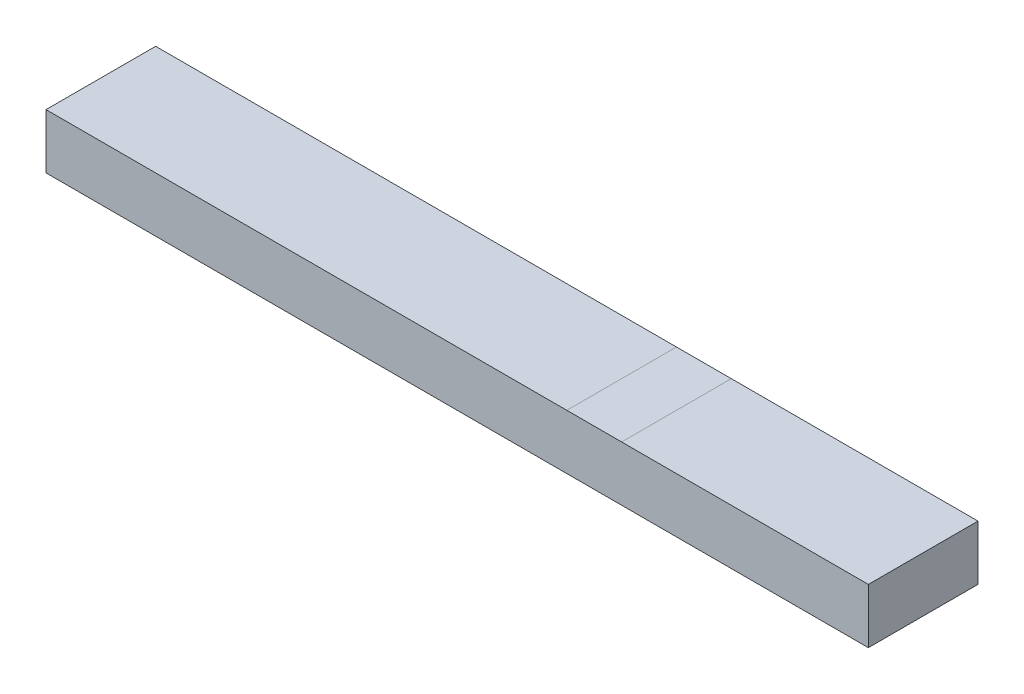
ISO-10303-21;
HEADER;
FILE_DESCRIPTION(('STEP AP214'),'2;1');
FILE_NAME('part.step','',(''),(''),'','','');
FILE_SCHEMA(('AUTOMOTIVE_DESIGN { 1 0 10303 214 1 1 1 1 }'));
ENDSEC;
DATA;
#1=APPLICATION_CONTEXT('core data for automotive mechanical design processes');
#2=APPLICATION_PROTOCOL_DEFINITION('international standard','automotive_design',2000,#1);
#3=PRODUCT_CONTEXT('',#1,'mechanical');
#4=PRODUCT('Part','Part','',(#3));
#5=PRODUCT_RELATED_PRODUCT_CATEGORY('part','',(#4));
#6=PRODUCT_DEFINITION_FORMATION('','',#4);
#7=PRODUCT_DEFINITION_CONTEXT('part definition',#1,'design');
#8=PRODUCT_DEFINITION('design','',#6,#7);
#9=PRODUCT_DEFINITION_SHAPE('','',#8);
#10=(LENGTH_UNIT() NAMED_UNIT(*) SI_UNIT(.MILLI.,.METRE.));
#11=(NAMED_UNIT(*) PLANE_ANGLE_UNIT() SI_UNIT($,.RADIAN.));
#12=(NAMED_UNIT(*) SI_UNIT($,.STERADIAN.) SOLID_ANGLE_UNIT());
#13=UNCERTAINTY_MEASURE_WITH_UNIT(LENGTH_MEASURE(1.E-05),#10,'distance_accuracy_value','');
#14=(GEOMETRIC_REPRESENTATION_CONTEXT(3) GLOBAL_UNCERTAINTY_ASSIGNED_CONTEXT((#13)) GLOBAL_UNIT_ASSIGNED_CONTEXT((#10,
#11,#12)) REPRESENTATION_CONTEXT('',''));
#15=CARTESIAN_POINT('',(0.,0.,0.));
#16=DIRECTION('',(0.,0.,1.));
#17=DIRECTION('',(1.,0.,0.));
#18=AXIS2_PLACEMENT_3D('',#15,#16,#17);
#19=CARTESIAN_POINT('',(750.,25.,50.));
#20=DIRECTION('',(0.,-1.,0.));
#21=DIRECTION('',(0.,0.,-1.));
#22=AXIS2_PLACEMENT_3D('',#19,#20,#21);
#23=PLANE('',#22);
#24=DIRECTION('',(0.,0.,1.));
#25=VECTOR('',#24,1.);
#26=CARTESIAN_POINT('',(525.,25.,50.));
#27=LINE('',#26,#25);
#28=CARTESIAN_POINT('',(525.,25.,-50.));
#29=VERTEX_POINT('',#28);
#30=CARTESIAN_POINT('',(525.,25.,50.));
#31=VERTEX_POINT('',#30);
#32=EDGE_CURVE('E11',#29,#31,#27,.T.);
#33=ORIENTED_EDGE('',*,*,#32,.F.);
#34=DIRECTION('',(-1.,0.,0.));
#35=VECTOR('',#34,1.);
#36=CARTESIAN_POINT('',(750.,25.,-50.));
#37=LINE('',#36,#35);
#38=CARTESIAN_POINT('',(475.,25.,-50.));
#39=VERTEX_POINT('',#38);
#40=EDGE_CURVE('E115',#29,#39,#37,.T.);
#41=ORIENTED_EDGE('',*,*,#40,.T.);
#42=DIRECTION('',(0.,0.,1.));
#43=VECTOR('',#42,1.);
#44=CARTESIAN_POINT('',(475.,25.,50.));
#45=LINE('',#44,#43);
#46=CARTESIAN_POINT('',(475.,25.,50.));
#47=VERTEX_POINT('',#46);
#48=EDGE_CURVE('E52',#39,#47,#45,.T.);
#49=ORIENTED_EDGE('',*,*,#48,.T.);
#50=DIRECTION('',(-1.,0.,0.));
#51=VECTOR('',#50,1.);
#52=CARTESIAN_POINT('',(750.,25.,50.));
#53=LINE('',#52,#51);
#54=EDGE_CURVE('E125',#31,#47,#53,.T.);
#55=ORIENTED_EDGE('',*,*,#54,.F.);
#56=EDGE_LOOP('',(#33,#41,#49,#55));
#57=FACE_BOUND('',#56,.T.);
#58=ADVANCED_FACE('F43',(#57),#23,.F.);
#59=ORIENTED_EDGE('',*,*,#48,.F.);
#60=CARTESIAN_POINT('',(0.,25.,-50.));
#61=VERTEX_POINT('',#60);
#62=EDGE_CURVE('E117',#39,#61,#37,.T.);
#63=ORIENTED_EDGE('',*,*,#62,.T.);
#64=DIRECTION('',(0.,0.,1.));
#65=VECTOR('',#64,1.);
#66=CARTESIAN_POINT('',(0.,25.,50.));
#67=LINE('',#66,#65);
#68=CARTESIAN_POINT('',(0.,25.,50.));
#69=VERTEX_POINT('',#68);
#70=EDGE_CURVE('E144',#61,#69,#67,.T.);
#71=ORIENTED_EDGE('',*,*,#70,.T.);
#72=EDGE_CURVE('E126',#47,#69,#53,.T.);
#73=ORIENTED_EDGE('',*,*,#72,.F.);
#74=EDGE_LOOP('',(#59,#63,#71,#73));
#75=FACE_BOUND('',#74,.T.);
#76=ADVANCED_FACE('F156',(#75),#23,.F.);
#77=CARTESIAN_POINT('',(750.,-25.,-50.));
#78=DIRECTION('',(0.,0.,1.));
#79=DIRECTION('',(1.,0.,0.));
#80=AXIS2_PLACEMENT_3D('',#77,#78,#79);
#81=PLANE('',#80);
#82=DIRECTION('',(0.,1.,0.));
#83=VECTOR('',#82,1.);
#84=CARTESIAN_POINT('',(0.,-25.,-50.));
#85=LINE('',#84,#83);
#86=CARTESIAN_POINT('',(0.,-25.,-50.));
#87=VERTEX_POINT('',#86);
#88=EDGE_CURVE('E146',#87,#61,#85,.T.);
#89=ORIENTED_EDGE('',*,*,#88,.T.);
#90=ORIENTED_EDGE('',*,*,#62,.F.);
#91=ORIENTED_EDGE('',*,*,#40,.F.);
#92=CARTESIAN_POINT('',(750.,25.,-50.));
#93=VERTEX_POINT('',#92);
#94=EDGE_CURVE('E95',#93,#29,#37,.T.);
#95=ORIENTED_EDGE('',*,*,#94,.F.);
#96=DIRECTION('',(0.,1.,0.));
#97=VECTOR('',#96,1.);
#98=CARTESIAN_POINT('',(750.,-25.,-50.));
#99=LINE('',#98,#97);
#100=CARTESIAN_POINT('',(750.,-25.,-50.));
#101=VERTEX_POINT('',#100);
#102=EDGE_CURVE('E102',#101,#93,#99,.T.);
#103=ORIENTED_EDGE('',*,*,#102,.F.);
#104=DIRECTION('',(-1.,0.,0.));
#105=VECTOR('',#104,1.);
#106=CARTESIAN_POINT('',(750.,-25.,-50.));
#107=LINE('',#106,#105);
#108=EDGE_CURVE('E135',#101,#87,#107,.T.);
#109=ORIENTED_EDGE('',*,*,#108,.T.);
#110=EDGE_LOOP('',(#89,#90,#91,#95,#103,#109));
#111=FACE_BOUND('',#110,.T.);
#112=ADVANCED_FACE('F45',(#111),#81,.F.);
#113=ORIENTED_EDGE('',*,*,#94,.T.);
#114=ORIENTED_EDGE('',*,*,#32,.T.);
#115=CARTESIAN_POINT('',(750.,25.,50.));
#116=VERTEX_POINT('',#115);
#117=EDGE_CURVE('E97',#116,#31,#53,.T.);
#118=ORIENTED_EDGE('',*,*,#117,.F.);
#119=DIRECTION('',(0.,0.,1.));
#120=VECTOR('',#119,1.);
#121=CARTESIAN_POINT('',(750.,25.,50.));
#122=LINE('',#121,#120);
#123=EDGE_CURVE('E91',#93,#116,#122,.T.);
#124=ORIENTED_EDGE('',*,*,#123,.F.);
#125=EDGE_LOOP('',(#113,#114,#118,#124));
#126=FACE_BOUND('',#125,.T.);
#127=ADVANCED_FACE('F93',(#126),#23,.F.);
#128=CARTESIAN_POINT('',(750.,-25.,50.));
#129=DIRECTION('',(0.,0.,-1.));
#130=DIRECTION('',(-1.,0.,0.));
#131=AXIS2_PLACEMENT_3D('',#128,#129,#130);
#132=PLANE('',#131);
#133=DIRECTION('',(0.,-1.,0.));
#134=VECTOR('',#133,1.);
#135=CARTESIAN_POINT('',(0.,-25.,50.));
#136=LINE('',#135,#134);
#137=CARTESIAN_POINT('',(0.,-25.,50.));
#138=VERTEX_POINT('',#137);
#139=EDGE_CURVE('E142',#69,#138,#136,.T.);
#140=ORIENTED_EDGE('',*,*,#139,.T.);
#141=DIRECTION('',(-1.,0.,0.));
#142=VECTOR('',#141,1.);
#143=CARTESIAN_POINT('',(750.,-25.,50.));
#144=LINE('',#143,#142);
#145=CARTESIAN_POINT('',(750.,-25.,50.));
#146=VERTEX_POINT('',#145);
#147=EDGE_CURVE('E130',#146,#138,#144,.T.);
#148=ORIENTED_EDGE('',*,*,#147,.F.);
#149=DIRECTION('',(0.,-1.,0.));
#150=VECTOR('',#149,1.);
#151=CARTESIAN_POINT('',(750.,-25.,50.));
#152=LINE('',#151,#150);
#153=EDGE_CURVE('E101',#116,#146,#152,.T.);
#154=ORIENTED_EDGE('',*,*,#153,.F.);
#155=ORIENTED_EDGE('',*,*,#117,.T.);
#156=ORIENTED_EDGE('',*,*,#54,.T.);
#157=ORIENTED_EDGE('',*,*,#72,.T.);
#158=EDGE_LOOP('',(#140,#148,#154,#155,#156,#157));
#159=FACE_BOUND('',#158,.T.);
#160=ADVANCED_FACE('F150',(#159),#132,.F.);
#161=CARTESIAN_POINT('',(750.,-25.,50.));
#162=DIRECTION('',(0.,1.,0.));
#163=DIRECTION('',(0.,0.,1.));
#164=AXIS2_PLACEMENT_3D('',#161,#162,#163);
#165=PLANE('',#164);
#166=DIRECTION('',(0.,0.,-1.));
#167=VECTOR('',#166,1.);
#168=CARTESIAN_POINT('',(0.,-25.,50.));
#169=LINE('',#168,#167);
#170=EDGE_CURVE('E111',#138,#87,#169,.T.);
#171=ORIENTED_EDGE('',*,*,#170,.T.);
#172=ORIENTED_EDGE('',*,*,#108,.F.);
#173=DIRECTION('',(0.,0.,-1.));
#174=VECTOR('',#173,1.);
#175=CARTESIAN_POINT('',(750.,-25.,50.));
#176=LINE('',#175,#174);
#177=EDGE_CURVE('E107',#146,#101,#176,.T.);
#178=ORIENTED_EDGE('',*,*,#177,.F.);
#179=ORIENTED_EDGE('',*,*,#147,.T.);
#180=EDGE_LOOP('',(#171,#172,#178,#179));
#181=FACE_BOUND('',#180,.T.);
#182=ADVANCED_FACE('F152',(#181),#165,.F.);
#183=CARTESIAN_POINT('',(750.,0.,0.));
#184=DIRECTION('',(-1.,0.,0.));
#185=DIRECTION('',(0.,0.,1.));
#186=AXIS2_PLACEMENT_3D('',#183,#184,#185);
#187=PLANE('',#186);
#188=ORIENTED_EDGE('',*,*,#102,.T.);
#189=ORIENTED_EDGE('',*,*,#123,.T.);
#190=ORIENTED_EDGE('',*,*,#153,.T.);
#191=ORIENTED_EDGE('',*,*,#177,.T.);
#192=EDGE_LOOP('',(#188,#189,#190,#191));
#193=FACE_BOUND('',#192,.T.);
#194=ADVANCED_FACE('F105',(#193),#187,.F.);
#195=CARTESIAN_POINT('',(0.,0.,0.));
#196=DIRECTION('',(-1.,0.,0.));
#197=DIRECTION('',(0.,0.,1.));
#198=AXIS2_PLACEMENT_3D('',#195,#196,#197);
#199=PLANE('',#198);
#200=ORIENTED_EDGE('',*,*,#88,.F.);
#201=ORIENTED_EDGE('',*,*,#170,.F.);
#202=ORIENTED_EDGE('',*,*,#139,.F.);
#203=ORIENTED_EDGE('',*,*,#70,.F.);
#204=EDGE_LOOP('',(#200,#201,#202,#203));
#205=FACE_BOUND('',#204,.T.);
#206=ADVANCED_FACE('F155',(#205),#199,.T.);
#207=CLOSED_SHELL('',(#58,#76,#112,#127,#160,#182,#194,#206));
#208=MANIFOLD_SOLID_BREP('B2',#207);
#209=ADVANCED_BREP_SHAPE_REPRESENTATION('',(#18,#208),#14);
#210=SHAPE_DEFINITION_REPRESENTATION(#9,#209);
ENDSEC;
END-ISO-10303-21;
